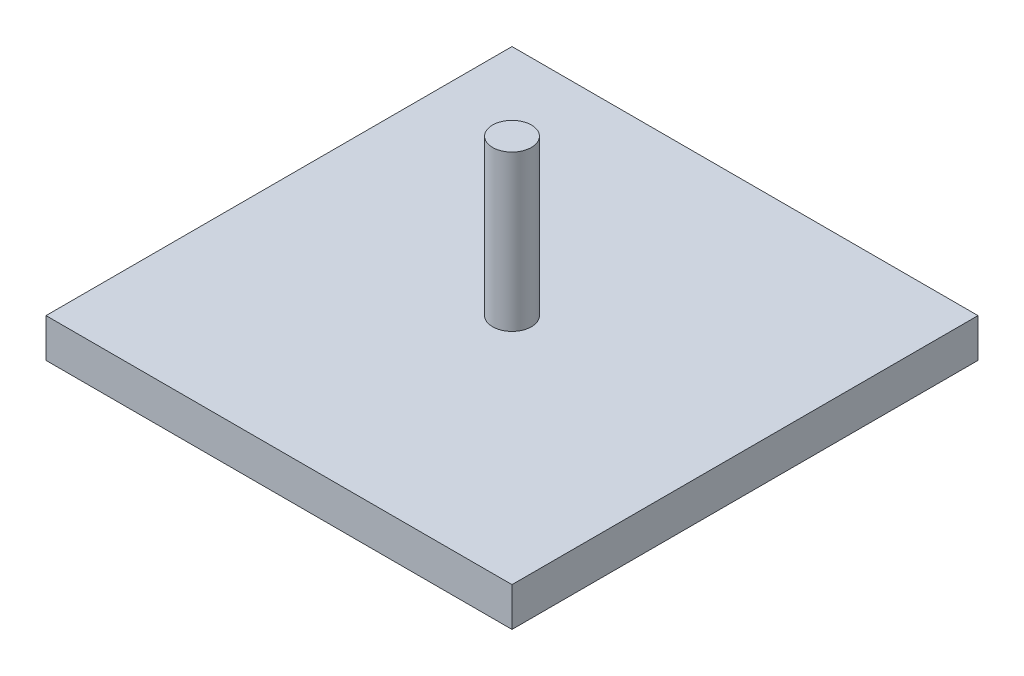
ISO-10303-21;
HEADER;
FILE_DESCRIPTION(('STEP AP214'),'2;1');
FILE_NAME('part.step','',(''),(''),'','','');
FILE_SCHEMA(('AUTOMOTIVE_DESIGN { 1 0 10303 214 1 1 1 1 }'));
ENDSEC;
DATA;
#1=APPLICATION_CONTEXT('core data for automotive mechanical design processes');
#2=APPLICATION_PROTOCOL_DEFINITION('international standard','automotive_design',2000,#1);
#3=PRODUCT_CONTEXT('',#1,'mechanical');
#4=PRODUCT('Part','Part','',(#3));
#5=PRODUCT_RELATED_PRODUCT_CATEGORY('part','',(#4));
#6=PRODUCT_DEFINITION_FORMATION('','',#4);
#7=PRODUCT_DEFINITION_CONTEXT('part definition',#1,'design');
#8=PRODUCT_DEFINITION('design','',#6,#7);
#9=PRODUCT_DEFINITION_SHAPE('','',#8);
#10=(LENGTH_UNIT() NAMED_UNIT(*) SI_UNIT(.MILLI.,.METRE.));
#11=(NAMED_UNIT(*) PLANE_ANGLE_UNIT() SI_UNIT($,.RADIAN.));
#12=(NAMED_UNIT(*) SI_UNIT($,.STERADIAN.) SOLID_ANGLE_UNIT());
#13=UNCERTAINTY_MEASURE_WITH_UNIT(LENGTH_MEASURE(1.E-05),#10,'distance_accuracy_value','');
#14=(GEOMETRIC_REPRESENTATION_CONTEXT(3) GLOBAL_UNCERTAINTY_ASSIGNED_CONTEXT((#13)) GLOBAL_UNIT_ASSIGNED_CONTEXT((#10,
#11,#12)) REPRESENTATION_CONTEXT('',''));
#15=CARTESIAN_POINT('',(0.,0.,0.));
#16=DIRECTION('',(0.,0.,1.));
#17=DIRECTION('',(1.,0.,0.));
#18=AXIS2_PLACEMENT_3D('',#15,#16,#17);
#19=CARTESIAN_POINT('',(-152.4,12.7,-152.4));
#20=DIRECTION('',(1.,0.,0.));
#21=DIRECTION('',(0.,0.,-1.));
#22=AXIS2_PLACEMENT_3D('',#19,#20,#21);
#23=PLANE('',#22);
#24=DIRECTION('',(0.,0.,1.));
#25=VECTOR('',#24,1.);
#26=CARTESIAN_POINT('',(-152.4,-12.7,-152.4));
#27=LINE('',#26,#25);
#28=CARTESIAN_POINT('',(-152.4,-12.7,-152.4));
#29=VERTEX_POINT('',#28);
#30=CARTESIAN_POINT('',(-152.4,-12.7,152.4));
#31=VERTEX_POINT('',#30);
#32=EDGE_CURVE('E97',#29,#31,#27,.T.);
#33=ORIENTED_EDGE('',*,*,#32,.T.);
#34=DIRECTION('',(0.,-1.,0.));
#35=VECTOR('',#34,1.);
#36=CARTESIAN_POINT('',(-152.4,12.7,152.4));
#37=LINE('',#36,#35);
#38=CARTESIAN_POINT('',(-152.4,12.7,152.4));
#39=VERTEX_POINT('',#38);
#40=EDGE_CURVE('E11',#39,#31,#37,.T.);
#41=ORIENTED_EDGE('',*,*,#40,.F.);
#42=DIRECTION('',(0.,0.,1.));
#43=VECTOR('',#42,1.);
#44=CARTESIAN_POINT('',(-152.4,12.7,-152.4));
#45=LINE('',#44,#43);
#46=CARTESIAN_POINT('',(-152.4,12.7,-152.4));
#47=VERTEX_POINT('',#46);
#48=EDGE_CURVE('E85',#47,#39,#45,.T.);
#49=ORIENTED_EDGE('',*,*,#48,.F.);
#50=DIRECTION('',(0.,-1.,0.));
#51=VECTOR('',#50,1.);
#52=CARTESIAN_POINT('',(-152.4,12.7,-152.4));
#53=LINE('',#52,#51);
#54=EDGE_CURVE('E93',#47,#29,#53,.T.);
#55=ORIENTED_EDGE('',*,*,#54,.T.);
#56=EDGE_LOOP('',(#33,#41,#49,#55));
#57=FACE_BOUND('',#56,.T.);
#58=ADVANCED_FACE('F34',(#57),#23,.F.);
#59=CARTESIAN_POINT('',(-152.4,12.7,152.4));
#60=DIRECTION('',(0.,0.,-1.));
#61=DIRECTION('',(-1.,0.,0.));
#62=AXIS2_PLACEMENT_3D('',#59,#60,#61);
#63=PLANE('',#62);
#64=DIRECTION('',(1.,0.,0.));
#65=VECTOR('',#64,1.);
#66=CARTESIAN_POINT('',(-152.4,-12.7,152.4));
#67=LINE('',#66,#65);
#68=CARTESIAN_POINT('',(152.4,-12.7,152.4));
#69=VERTEX_POINT('',#68);
#70=EDGE_CURVE('E89',#31,#69,#67,.T.);
#71=ORIENTED_EDGE('',*,*,#70,.T.);
#72=DIRECTION('',(0.,-1.,0.));
#73=VECTOR('',#72,1.);
#74=CARTESIAN_POINT('',(152.4,12.7,152.4));
#75=LINE('',#74,#73);
#76=CARTESIAN_POINT('',(152.4,12.7,152.4));
#77=VERTEX_POINT('',#76);
#78=EDGE_CURVE('E42',#77,#69,#75,.T.);
#79=ORIENTED_EDGE('',*,*,#78,.F.);
#80=DIRECTION('',(1.,0.,0.));
#81=VECTOR('',#80,1.);
#82=CARTESIAN_POINT('',(-152.4,12.7,152.4));
#83=LINE('',#82,#81);
#84=EDGE_CURVE('E80',#39,#77,#83,.T.);
#85=ORIENTED_EDGE('',*,*,#84,.F.);
#86=ORIENTED_EDGE('',*,*,#40,.T.);
#87=EDGE_LOOP('',(#71,#79,#85,#86));
#88=FACE_BOUND('',#87,.T.);
#89=ADVANCED_FACE('F88',(#88),#63,.F.);
#90=CARTESIAN_POINT('',(152.4,12.7,-152.4));
#91=DIRECTION('',(-1.,0.,0.));
#92=DIRECTION('',(0.,0.,1.));
#93=AXIS2_PLACEMENT_3D('',#90,#91,#92);
#94=PLANE('',#93);
#95=DIRECTION('',(0.,0.,-1.));
#96=VECTOR('',#95,1.);
#97=CARTESIAN_POINT('',(152.4,-12.7,-152.4));
#98=LINE('',#97,#96);
#99=CARTESIAN_POINT('',(152.4,-12.7,-152.4));
#100=VERTEX_POINT('',#99);
#101=EDGE_CURVE('E67',#69,#100,#98,.T.);
#102=ORIENTED_EDGE('',*,*,#101,.T.);
#103=DIRECTION('',(0.,-1.,0.));
#104=VECTOR('',#103,1.);
#105=CARTESIAN_POINT('',(152.4,12.7,-152.4));
#106=LINE('',#105,#104);
#107=CARTESIAN_POINT('',(152.4,12.7,-152.4));
#108=VERTEX_POINT('',#107);
#109=EDGE_CURVE('E90',#108,#100,#106,.T.);
#110=ORIENTED_EDGE('',*,*,#109,.F.);
#111=DIRECTION('',(0.,0.,-1.));
#112=VECTOR('',#111,1.);
#113=CARTESIAN_POINT('',(152.4,12.7,-152.4));
#114=LINE('',#113,#112);
#115=EDGE_CURVE('E83',#77,#108,#114,.T.);
#116=ORIENTED_EDGE('',*,*,#115,.F.);
#117=ORIENTED_EDGE('',*,*,#78,.T.);
#118=EDGE_LOOP('',(#102,#110,#116,#117));
#119=FACE_BOUND('',#118,.T.);
#120=ADVANCED_FACE('F91',(#119),#94,.F.);
#121=CARTESIAN_POINT('',(-152.4,12.7,-152.4));
#122=DIRECTION('',(0.,0.,1.));
#123=DIRECTION('',(1.,0.,0.));
#124=AXIS2_PLACEMENT_3D('',#121,#122,#123);
#125=PLANE('',#124);
#126=DIRECTION('',(-1.,0.,0.));
#127=VECTOR('',#126,1.);
#128=CARTESIAN_POINT('',(-152.4,-12.7,-152.4));
#129=LINE('',#128,#127);
#130=EDGE_CURVE('E73',#100,#29,#129,.T.);
#131=ORIENTED_EDGE('',*,*,#130,.T.);
#132=ORIENTED_EDGE('',*,*,#54,.F.);
#133=DIRECTION('',(-1.,0.,0.));
#134=VECTOR('',#133,1.);
#135=CARTESIAN_POINT('',(-152.4,12.7,-152.4));
#136=LINE('',#135,#134);
#137=EDGE_CURVE('E50',#108,#47,#136,.T.);
#138=ORIENTED_EDGE('',*,*,#137,.F.);
#139=ORIENTED_EDGE('',*,*,#109,.T.);
#140=EDGE_LOOP('',(#131,#132,#138,#139));
#141=FACE_BOUND('',#140,.T.);
#142=ADVANCED_FACE('F105',(#141),#125,.F.);
#143=CARTESIAN_POINT('',(0.,12.7,0.));
#144=DIRECTION('',(0.,1.,0.));
#145=DIRECTION('',(0.,0.,1.));
#146=AXIS2_PLACEMENT_3D('',#143,#144,#145);
#147=PLANE('',#146);
#148=CARTESIAN_POINT('',(0.,12.7,0.));
#149=DIRECTION('',(0.,1.,0.));
#150=DIRECTION('',(0.,0.,1.));
#151=AXIS2_PLACEMENT_3D('',#148,#149,#150);
#152=CIRCLE('',#151,12.7);
#153=CARTESIAN_POINT('',(0.,12.7,12.7));
#154=VERTEX_POINT('',#153);
#155=EDGE_CURVE('E111',#154,#154,#152,.T.);
#156=ORIENTED_EDGE('',*,*,#155,.F.);
#157=EDGE_LOOP('',(#156));
#158=FACE_BOUND('',#157,.T.);
#159=ORIENTED_EDGE('',*,*,#48,.T.);
#160=ORIENTED_EDGE('',*,*,#84,.T.);
#161=ORIENTED_EDGE('',*,*,#115,.T.);
#162=ORIENTED_EDGE('',*,*,#137,.T.);
#163=EDGE_LOOP('',(#159,#160,#161,#162));
#164=FACE_BOUND('',#163,.T.);
#165=ADVANCED_FACE('F81',(#158,#164),#147,.T.);
#166=CARTESIAN_POINT('',(0.,-12.7,0.));
#167=DIRECTION('',(0.,1.,0.));
#168=DIRECTION('',(0.,0.,1.));
#169=AXIS2_PLACEMENT_3D('',#166,#167,#168);
#170=PLANE('',#169);
#171=ORIENTED_EDGE('',*,*,#32,.F.);
#172=ORIENTED_EDGE('',*,*,#130,.F.);
#173=ORIENTED_EDGE('',*,*,#101,.F.);
#174=ORIENTED_EDGE('',*,*,#70,.F.);
#175=EDGE_LOOP('',(#171,#172,#173,#174));
#176=FACE_BOUND('',#175,.T.);
#177=ADVANCED_FACE('F108',(#176),#170,.F.);
#178=CARTESIAN_POINT('',(0.,114.3,0.));
#179=DIRECTION('',(0.,-1.,0.));
#180=DIRECTION('',(0.,0.,-1.));
#181=AXIS2_PLACEMENT_3D('',#178,#179,#180);
#182=CYLINDRICAL_SURFACE('',#181,12.7);
#183=CARTESIAN_POINT('',(0.,114.3,0.));
#184=DIRECTION('',(0.,1.,0.));
#185=DIRECTION('',(0.,0.,1.));
#186=AXIS2_PLACEMENT_3D('',#183,#184,#185);
#187=CIRCLE('',#186,12.7);
#188=CARTESIAN_POINT('',(0.,114.3,12.7));
#189=VERTEX_POINT('',#188);
#190=EDGE_CURVE('E100',#189,#189,#187,.T.);
#191=ORIENTED_EDGE('',*,*,#190,.F.);
#192=EDGE_LOOP('',(#191));
#193=FACE_BOUND('',#192,.T.);
#194=ORIENTED_EDGE('',*,*,#155,.T.);
#195=EDGE_LOOP('',(#194));
#196=FACE_BOUND('',#195,.T.);
#197=ADVANCED_FACE('F119',(#193,#196),#182,.T.);
#198=CARTESIAN_POINT('',(0.,114.3,0.));
#199=DIRECTION('',(0.,1.,0.));
#200=DIRECTION('',(0.,0.,1.));
#201=AXIS2_PLACEMENT_3D('',#198,#199,#200);
#202=PLANE('',#201);
#203=ORIENTED_EDGE('',*,*,#190,.T.);
#204=EDGE_LOOP('',(#203));
#205=FACE_BOUND('',#204,.T.);
#206=ADVANCED_FACE('F117',(#205),#202,.T.);
#207=CLOSED_SHELL('',(#58,#89,#120,#142,#165,#177,#197,#206));
#208=MANIFOLD_SOLID_BREP('B2',#207);
#209=ADVANCED_BREP_SHAPE_REPRESENTATION('',(#18,#208),#14);
#210=SHAPE_DEFINITION_REPRESENTATION(#9,#209);
ENDSEC;
END-ISO-10303-21;
